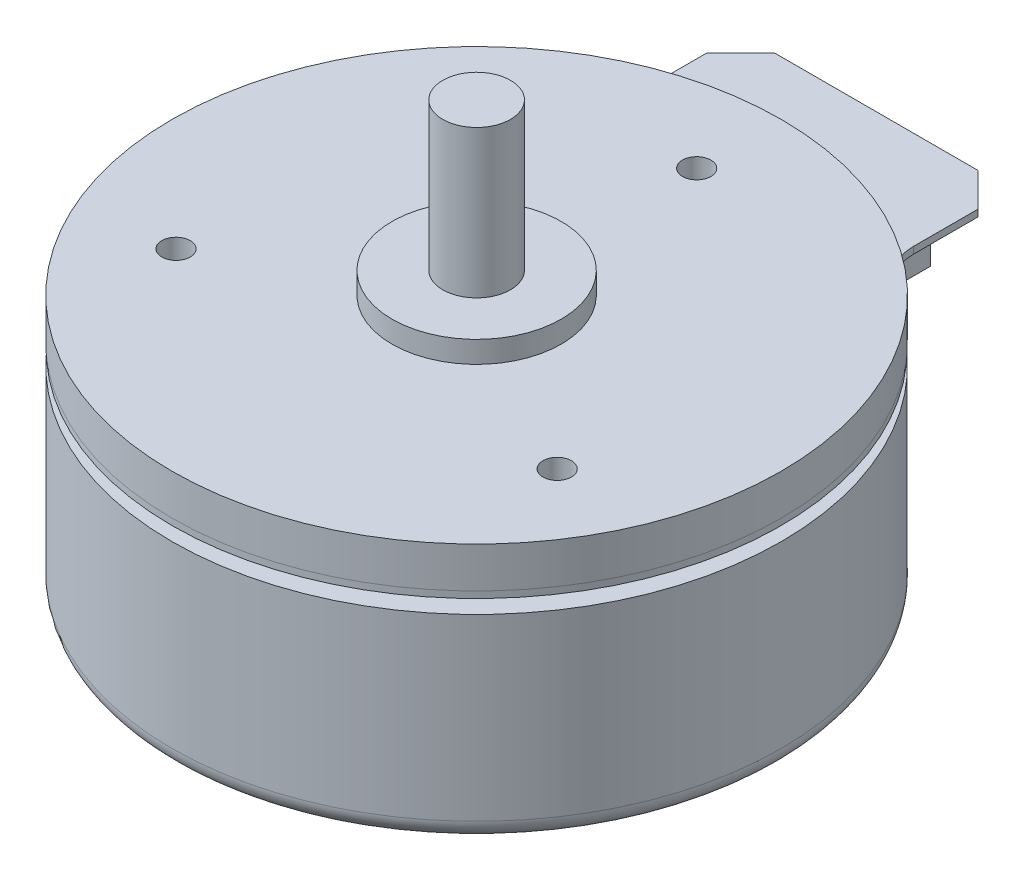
ISO-10303-21;
HEADER;
FILE_DESCRIPTION(('STEP AP214'),'2;1');
FILE_NAME('part.step','',(''),(''),'','','');
FILE_SCHEMA(('AUTOMOTIVE_DESIGN { 1 0 10303 214 1 1 1 1 }'));
ENDSEC;
DATA;
#1=APPLICATION_CONTEXT('core data for automotive mechanical design processes');
#2=APPLICATION_PROTOCOL_DEFINITION('international standard','automotive_design',2000,#1);
#3=PRODUCT_CONTEXT('',#1,'mechanical');
#4=PRODUCT('Part','Part','',(#3));
#5=PRODUCT_RELATED_PRODUCT_CATEGORY('part','',(#4));
#6=PRODUCT_DEFINITION_FORMATION('','',#4);
#7=PRODUCT_DEFINITION_CONTEXT('part definition',#1,'design');
#8=PRODUCT_DEFINITION('design','',#6,#7);
#9=PRODUCT_DEFINITION_SHAPE('','',#8);
#10=(LENGTH_UNIT() NAMED_UNIT(*) SI_UNIT(.MILLI.,.METRE.));
#11=(NAMED_UNIT(*) PLANE_ANGLE_UNIT() SI_UNIT($,.RADIAN.));
#12=(NAMED_UNIT(*) SI_UNIT($,.STERADIAN.) SOLID_ANGLE_UNIT());
#13=UNCERTAINTY_MEASURE_WITH_UNIT(LENGTH_MEASURE(1.E-05),#10,'distance_accuracy_value','');
#14=(GEOMETRIC_REPRESENTATION_CONTEXT(3) GLOBAL_UNCERTAINTY_ASSIGNED_CONTEXT((#13)) GLOBAL_UNIT_ASSIGNED_CONTEXT((#10,
#11,#12)) REPRESENTATION_CONTEXT('',''));
#15=CARTESIAN_POINT('',(0.,0.,0.));
#16=DIRECTION('',(0.,0.,1.));
#17=DIRECTION('',(1.,0.,0.));
#18=AXIS2_PLACEMENT_3D('',#15,#16,#17);
#19=CARTESIAN_POINT('',(0.,6.,0.));
#20=DIRECTION('',(0.,-1.,0.));
#21=DIRECTION('',(0.,0.,-1.));
#22=AXIS2_PLACEMENT_3D('',#19,#20,#21);
#23=CYLINDRICAL_SURFACE('',#22,45.);
#24=CARTESIAN_POINT('',(0.,6.,0.));
#25=DIRECTION('',(0.,1.,0.));
#26=DIRECTION('',(0.,0.,1.));
#27=AXIS2_PLACEMENT_3D('',#24,#25,#26);
#28=CIRCLE('',#27,45.);
#29=CARTESIAN_POINT('',(0.,6.,45.));
#30=VERTEX_POINT('',#29);
#31=EDGE_CURVE('E267',#30,#30,#28,.T.);
#32=ORIENTED_EDGE('',*,*,#31,.F.);
#33=EDGE_LOOP('',(#32));
#34=FACE_BOUND('',#33,.T.);
#35=CARTESIAN_POINT('',(0.,0.,0.));
#36=DIRECTION('',(0.,1.,0.));
#37=DIRECTION('',(0.,0.,1.));
#38=AXIS2_PLACEMENT_3D('',#35,#36,#37);
#39=CIRCLE('',#38,45.);
#40=CARTESIAN_POINT('',(22.8146582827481,0.,-38.7877734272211));
#41=VERTEX_POINT('',#40);
#42=CARTESIAN_POINT('',(-22.8146582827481,0.,-38.787773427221));
#43=VERTEX_POINT('',#42);
#44=EDGE_CURVE('E270',#41,#43,#39,.T.);
#45=ORIENTED_EDGE('',*,*,#44,.T.);
#46=EDGE_CURVE('E263',#43,#41,#39,.T.);
#47=ORIENTED_EDGE('',*,*,#46,.T.);
#48=EDGE_LOOP('',(#45,#47));
#49=FACE_BOUND('',#48,.T.);
#50=ADVANCED_FACE('F35',(#34,#49),#23,.T.);
#51=CARTESIAN_POINT('',(0.,6.,0.));
#52=DIRECTION('',(0.,1.,0.));
#53=DIRECTION('',(0.,0.,1.));
#54=AXIS2_PLACEMENT_3D('',#51,#52,#53);
#55=PLANE('',#54);
#56=CARTESIAN_POINT('',(0.,6.,-32.5));
#57=DIRECTION('',(0.,1.,0.));
#58=DIRECTION('',(0.,0.,1.));
#59=AXIS2_PLACEMENT_3D('',#56,#57,#58);
#60=CIRCLE('',#59,2.1);
#61=CARTESIAN_POINT('',(0.,6.,-30.4));
#62=VERTEX_POINT('',#61);
#63=EDGE_CURVE('E238',#62,#62,#60,.T.);
#64=ORIENTED_EDGE('',*,*,#63,.F.);
#65=EDGE_LOOP('',(#64));
#66=FACE_BOUND('',#65,.T.);
#67=CARTESIAN_POINT('',(28.1458256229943,6.,16.2499999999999));
#68=DIRECTION('',(0.,1.,0.));
#69=DIRECTION('',(0.,0.,1.));
#70=AXIS2_PLACEMENT_3D('',#67,#68,#69);
#71=CIRCLE('',#70,2.1);
#72=CARTESIAN_POINT('',(28.1458256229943,6.,18.3499999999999));
#73=VERTEX_POINT('',#72);
#74=EDGE_CURVE('E244',#73,#73,#71,.T.);
#75=ORIENTED_EDGE('',*,*,#74,.F.);
#76=EDGE_LOOP('',(#75));
#77=FACE_BOUND('',#76,.T.);
#78=CARTESIAN_POINT('',(-28.1458256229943,6.,16.2499999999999));
#79=DIRECTION('',(0.,1.,0.));
#80=DIRECTION('',(0.,0.,1.));
#81=AXIS2_PLACEMENT_3D('',#78,#79,#80);
#82=CIRCLE('',#81,2.1);
#83=CARTESIAN_POINT('',(-28.1458256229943,6.,18.3499999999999));
#84=VERTEX_POINT('',#83);
#85=EDGE_CURVE('E250',#84,#84,#82,.T.);
#86=ORIENTED_EDGE('',*,*,#85,.F.);
#87=EDGE_LOOP('',(#86));
#88=FACE_BOUND('',#87,.T.);
#89=CARTESIAN_POINT('',(0.,6.,0.));
#90=DIRECTION('',(0.,1.,0.));
#91=DIRECTION('',(0.,0.,1.));
#92=AXIS2_PLACEMENT_3D('',#89,#90,#91);
#93=CIRCLE('',#92,12.5);
#94=CARTESIAN_POINT('',(0.,6.,12.5));
#95=VERTEX_POINT('',#94);
#96=EDGE_CURVE('E264',#95,#95,#93,.T.);
#97=ORIENTED_EDGE('',*,*,#96,.F.);
#98=EDGE_LOOP('',(#97));
#99=FACE_BOUND('',#98,.T.);
#100=ORIENTED_EDGE('',*,*,#31,.T.);
#101=EDGE_LOOP('',(#100));
#102=FACE_BOUND('',#101,.T.);
#103=ADVANCED_FACE('F343',(#66,#77,#88,#99,#102),#55,.T.);
#104=CARTESIAN_POINT('',(0.,0.,0.));
#105=DIRECTION('',(0.,1.,0.));
#106=DIRECTION('',(0.,0.,1.));
#107=AXIS2_PLACEMENT_3D('',#104,#105,#106);
#108=PLANE('',#107);
#109=CARTESIAN_POINT('',(27.25,0.,-44.5227750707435));
#110=DIRECTION('',(0.,1.,0.));
#111=DIRECTION('',(0.,0.,1.));
#112=AXIS2_PLACEMENT_3D('',#109,#110,#111);
#113=CIRCLE('',#112,7.25000000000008);
#114=CARTESIAN_POINT('',(23.4652777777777,0.,-38.3390563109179));
#115=VERTEX_POINT('',#114);
#116=EDGE_CURVE('E179',#41,#115,#113,.T.);
#117=ORIENTED_EDGE('',*,*,#116,.F.);
#118=ORIENTED_EDGE('',*,*,#46,.F.);
#119=CARTESIAN_POINT('',(-27.25,0.,-44.5227750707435));
#120=DIRECTION('',(0.,1.,0.));
#121=DIRECTION('',(0.,0.,-1.));
#122=AXIS2_PLACEMENT_3D('',#119,#120,#121);
#123=CIRCLE('',#122,7.25000000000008);
#124=CARTESIAN_POINT('',(-23.4652777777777,0.,-38.339056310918));
#125=VERTEX_POINT('',#124);
#126=EDGE_CURVE('E203',#125,#43,#123,.T.);
#127=ORIENTED_EDGE('',*,*,#126,.F.);
#128=CARTESIAN_POINT('',(0.,0.,0.));
#129=DIRECTION('',(0.,-1.,0.));
#130=DIRECTION('',(0.,0.,1.));
#131=AXIS2_PLACEMENT_3D('',#128,#129,#130);
#132=CIRCLE('',#131,44.95);
#133=EDGE_CURVE('E58',#115,#125,#132,.T.);
#134=ORIENTED_EDGE('',*,*,#133,.F.);
#135=EDGE_LOOP('',(#117,#118,#127,#134));
#136=FACE_BOUND('',#135,.T.);
#137=ADVANCED_FACE('F340',(#136),#108,.F.);
#138=CARTESIAN_POINT('',(0.,9.2,0.));
#139=DIRECTION('',(0.,-1.,0.));
#140=DIRECTION('',(0.,0.,-1.));
#141=AXIS2_PLACEMENT_3D('',#138,#139,#140);
#142=CYLINDRICAL_SURFACE('',#141,12.5);
#143=CARTESIAN_POINT('',(0.,9.2,0.));
#144=DIRECTION('',(0.,1.,0.));
#145=DIRECTION('',(0.,0.,1.));
#146=AXIS2_PLACEMENT_3D('',#143,#144,#145);
#147=CIRCLE('',#146,12.5);
#148=CARTESIAN_POINT('',(0.,9.2,12.5));
#149=VERTEX_POINT('',#148);
#150=EDGE_CURVE('E260',#149,#149,#147,.T.);
#151=ORIENTED_EDGE('',*,*,#150,.F.);
#152=EDGE_LOOP('',(#151));
#153=FACE_BOUND('',#152,.T.);
#154=ORIENTED_EDGE('',*,*,#96,.T.);
#155=EDGE_LOOP('',(#154));
#156=FACE_BOUND('',#155,.T.);
#157=ADVANCED_FACE('F342',(#153,#156),#142,.T.);
#158=CARTESIAN_POINT('',(0.,9.2,0.));
#159=DIRECTION('',(0.,1.,0.));
#160=DIRECTION('',(0.,0.,1.));
#161=AXIS2_PLACEMENT_3D('',#158,#159,#160);
#162=PLANE('',#161);
#163=CARTESIAN_POINT('',(0.,9.2,0.));
#164=DIRECTION('',(0.,1.,0.));
#165=DIRECTION('',(0.,0.,1.));
#166=AXIS2_PLACEMENT_3D('',#163,#164,#165);
#167=CIRCLE('',#166,5.);
#168=CARTESIAN_POINT('',(0.,9.2,5.));
#169=VERTEX_POINT('',#168);
#170=EDGE_CURVE('E259',#169,#169,#167,.F.);
#171=ORIENTED_EDGE('',*,*,#170,.T.);
#172=EDGE_LOOP('',(#171));
#173=FACE_BOUND('',#172,.T.);
#174=ORIENTED_EDGE('',*,*,#150,.T.);
#175=EDGE_LOOP('',(#174));
#176=FACE_BOUND('',#175,.T.);
#177=ADVANCED_FACE('F349',(#173,#176),#162,.T.);
#178=CARTESIAN_POINT('',(0.,31.,0.));
#179=DIRECTION('',(0.,-1.,0.));
#180=DIRECTION('',(0.,0.,-1.));
#181=AXIS2_PLACEMENT_3D('',#178,#179,#180);
#182=CYLINDRICAL_SURFACE('',#181,5.);
#183=ORIENTED_EDGE('',*,*,#170,.F.);
#184=EDGE_LOOP('',(#183));
#185=FACE_BOUND('',#184,.T.);
#186=CARTESIAN_POINT('',(0.,31.,0.));
#187=DIRECTION('',(0.,1.,0.));
#188=DIRECTION('',(0.,0.,1.));
#189=AXIS2_PLACEMENT_3D('',#186,#187,#188);
#190=CIRCLE('',#189,5.);
#191=CARTESIAN_POINT('',(0.,31.,5.));
#192=VERTEX_POINT('',#191);
#193=EDGE_CURVE('E256',#192,#192,#190,.T.);
#194=ORIENTED_EDGE('',*,*,#193,.F.);
#195=EDGE_LOOP('',(#194));
#196=FACE_BOUND('',#195,.T.);
#197=ADVANCED_FACE('F630',(#185,#196),#182,.T.);
#198=CARTESIAN_POINT('',(0.,31.,0.));
#199=DIRECTION('',(0.,1.,0.));
#200=DIRECTION('',(0.,0.,1.));
#201=AXIS2_PLACEMENT_3D('',#198,#199,#200);
#202=PLANE('',#201);
#203=ORIENTED_EDGE('',*,*,#193,.T.);
#204=EDGE_LOOP('',(#203));
#205=FACE_BOUND('',#204,.T.);
#206=ADVANCED_FACE('F372',(#205),#202,.T.);
#207=CARTESIAN_POINT('',(-28.1458256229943,1.46180729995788,16.2499999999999));
#208=DIRECTION('',(0.,1.,0.));
#209=DIRECTION('',(0.,0.,1.));
#210=AXIS2_PLACEMENT_3D('',#207,#208,#209);
#211=CONICAL_SURFACE('',#210,2.1,1.02974425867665);
#212=CARTESIAN_POINT('',(-28.1458256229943,0.200000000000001,16.2499999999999));
#213=VERTEX_POINT('',#212);
#214=VERTEX_LOOP('',#213);
#215=FACE_BOUND('',#214,.T.);
#216=CARTESIAN_POINT('',(-28.1458256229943,1.46180729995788,16.2499999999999));
#217=DIRECTION('',(0.,1.,0.));
#218=DIRECTION('',(0.,0.,1.));
#219=AXIS2_PLACEMENT_3D('',#216,#217,#218);
#220=CIRCLE('',#219,2.1);
#221=CARTESIAN_POINT('',(-28.1458256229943,1.46180729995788,18.3499999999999));
#222=VERTEX_POINT('',#221);
#223=EDGE_CURVE('E253',#222,#222,#220,.T.);
#224=ORIENTED_EDGE('',*,*,#223,.T.);
#225=EDGE_LOOP('',(#224));
#226=FACE_BOUND('',#225,.T.);
#227=ADVANCED_FACE('F377',(#215,#226),#211,.F.);
#228=CARTESIAN_POINT('',(-28.1458256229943,6.,16.2499999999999));
#229=DIRECTION('',(0.,1.,0.));
#230=DIRECTION('',(0.,0.,1.));
#231=AXIS2_PLACEMENT_3D('',#228,#229,#230);
#232=CYLINDRICAL_SURFACE('',#231,2.1);
#233=ORIENTED_EDGE('',*,*,#223,.F.);
#234=EDGE_LOOP('',(#233));
#235=FACE_BOUND('',#234,.T.);
#236=ORIENTED_EDGE('',*,*,#85,.T.);
#237=EDGE_LOOP('',(#236));
#238=FACE_BOUND('',#237,.T.);
#239=ADVANCED_FACE('F382',(#235,#238),#232,.F.);
#240=CARTESIAN_POINT('',(28.1458256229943,1.46180729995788,16.2499999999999));
#241=DIRECTION('',(0.,1.,0.));
#242=DIRECTION('',(0.,0.,1.));
#243=AXIS2_PLACEMENT_3D('',#240,#241,#242);
#244=CONICAL_SURFACE('',#243,2.1,1.02974425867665);
#245=CARTESIAN_POINT('',(28.1458256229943,0.200000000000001,16.2499999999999));
#246=VERTEX_POINT('',#245);
#247=VERTEX_LOOP('',#246);
#248=FACE_BOUND('',#247,.T.);
#249=CARTESIAN_POINT('',(28.1458256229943,1.46180729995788,16.2499999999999));
#250=DIRECTION('',(0.,1.,0.));
#251=DIRECTION('',(0.,0.,1.));
#252=AXIS2_PLACEMENT_3D('',#249,#250,#251);
#253=CIRCLE('',#252,2.1);
#254=CARTESIAN_POINT('',(28.1458256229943,1.46180729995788,18.3499999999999));
#255=VERTEX_POINT('',#254);
#256=EDGE_CURVE('E247',#255,#255,#253,.T.);
#257=ORIENTED_EDGE('',*,*,#256,.T.);
#258=EDGE_LOOP('',(#257));
#259=FACE_BOUND('',#258,.T.);
#260=ADVANCED_FACE('F392',(#248,#259),#244,.F.);
#261=CARTESIAN_POINT('',(28.1458256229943,6.,16.2499999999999));
#262=DIRECTION('',(0.,1.,0.));
#263=DIRECTION('',(0.,0.,1.));
#264=AXIS2_PLACEMENT_3D('',#261,#262,#263);
#265=CYLINDRICAL_SURFACE('',#264,2.1);
#266=ORIENTED_EDGE('',*,*,#256,.F.);
#267=EDGE_LOOP('',(#266));
#268=FACE_BOUND('',#267,.T.);
#269=ORIENTED_EDGE('',*,*,#74,.T.);
#270=EDGE_LOOP('',(#269));
#271=FACE_BOUND('',#270,.T.);
#272=ADVANCED_FACE('F402',(#268,#271),#265,.F.);
#273=CARTESIAN_POINT('',(0.,1.46180729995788,-32.5));
#274=DIRECTION('',(0.,1.,0.));
#275=DIRECTION('',(0.,0.,1.));
#276=AXIS2_PLACEMENT_3D('',#273,#274,#275);
#277=CONICAL_SURFACE('',#276,2.1,1.02974425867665);
#278=CARTESIAN_POINT('',(0.,0.200000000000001,-32.5));
#279=VERTEX_POINT('',#278);
#280=VERTEX_LOOP('',#279);
#281=FACE_BOUND('',#280,.T.);
#282=CARTESIAN_POINT('',(0.,1.46180729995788,-32.5));
#283=DIRECTION('',(0.,1.,0.));
#284=DIRECTION('',(0.,0.,1.));
#285=AXIS2_PLACEMENT_3D('',#282,#283,#284);
#286=CIRCLE('',#285,2.1);
#287=CARTESIAN_POINT('',(0.,1.46180729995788,-30.4));
#288=VERTEX_POINT('',#287);
#289=EDGE_CURVE('E241',#288,#288,#286,.T.);
#290=ORIENTED_EDGE('',*,*,#289,.T.);
#291=EDGE_LOOP('',(#290));
#292=FACE_BOUND('',#291,.T.);
#293=ADVANCED_FACE('F412',(#281,#292),#277,.F.);
#294=CARTESIAN_POINT('',(0.,6.,-32.5));
#295=DIRECTION('',(0.,1.,0.));
#296=DIRECTION('',(0.,0.,1.));
#297=AXIS2_PLACEMENT_3D('',#294,#295,#296);
#298=CYLINDRICAL_SURFACE('',#297,2.1);
#299=ORIENTED_EDGE('',*,*,#289,.F.);
#300=EDGE_LOOP('',(#299));
#301=FACE_BOUND('',#300,.T.);
#302=ORIENTED_EDGE('',*,*,#63,.T.);
#303=EDGE_LOOP('',(#302));
#304=FACE_BOUND('',#303,.T.);
#305=ADVANCED_FACE('F421',(#301,#304),#298,.F.);
#306=CARTESIAN_POINT('',(27.25,0.,-44.5227750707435));
#307=DIRECTION('',(0.,1.,0.));
#308=DIRECTION('',(0.,0.,1.));
#309=AXIS2_PLACEMENT_3D('',#306,#307,#308);
#310=PLANE('',#309);
#311=ORIENTED_EDGE('',*,*,#44,.F.);
#312=CARTESIAN_POINT('',(20.,0.,-44.5227750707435));
#313=VERTEX_POINT('',#312);
#314=EDGE_CURVE('E174',#313,#41,#113,.T.);
#315=ORIENTED_EDGE('',*,*,#314,.F.);
#316=DIRECTION('',(0.,0.,1.));
#317=VECTOR('',#316,1.);
#318=CARTESIAN_POINT('',(20.,0.,-44.5227750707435));
#319=LINE('',#318,#317);
#320=CARTESIAN_POINT('',(20.,0.,-54.0502525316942));
#321=VERTEX_POINT('',#320);
#322=EDGE_CURVE('E184',#321,#313,#319,.T.);
#323=ORIENTED_EDGE('',*,*,#322,.F.);
#324=DIRECTION('',(0.707106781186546,0.,0.707106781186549));
#325=VECTOR('',#324,1.);
#326=CARTESIAN_POINT('',(20.,0.,-54.0502525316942));
#327=LINE('',#326,#325);
#328=CARTESIAN_POINT('',(15.0502525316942,0.,-59.));
#329=VERTEX_POINT('',#328);
#330=EDGE_CURVE('E212',#329,#321,#327,.T.);
#331=ORIENTED_EDGE('',*,*,#330,.F.);
#332=DIRECTION('',(1.,0.,0.));
#333=VECTOR('',#332,1.);
#334=CARTESIAN_POINT('',(15.0502525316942,0.,-59.));
#335=LINE('',#334,#333);
#336=CARTESIAN_POINT('',(-15.0502525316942,0.,-59.));
#337=VERTEX_POINT('',#336);
#338=EDGE_CURVE('E210',#337,#329,#335,.T.);
#339=ORIENTED_EDGE('',*,*,#338,.F.);
#340=DIRECTION('',(0.707106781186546,0.,-0.707106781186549));
#341=VECTOR('',#340,1.);
#342=CARTESIAN_POINT('',(-15.0502525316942,0.,-59.));
#343=LINE('',#342,#341);
#344=CARTESIAN_POINT('',(-20.,0.,-54.0502525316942));
#345=VERTEX_POINT('',#344);
#346=EDGE_CURVE('E208',#345,#337,#343,.T.);
#347=ORIENTED_EDGE('',*,*,#346,.F.);
#348=DIRECTION('',(0.,0.,-1.));
#349=VECTOR('',#348,1.);
#350=CARTESIAN_POINT('',(-20.,0.,-54.0502525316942));
#351=LINE('',#350,#349);
#352=CARTESIAN_POINT('',(-20.,0.,-44.5227750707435));
#353=VERTEX_POINT('',#352);
#354=EDGE_CURVE('E206',#353,#345,#351,.T.);
#355=ORIENTED_EDGE('',*,*,#354,.F.);
#356=EDGE_CURVE('E202',#43,#353,#123,.T.);
#357=ORIENTED_EDGE('',*,*,#356,.F.);
#358=EDGE_LOOP('',(#311,#315,#323,#331,#339,#347,#355,#357));
#359=FACE_BOUND('',#358,.T.);
#360=ADVANCED_FACE('F336',(#359),#310,.T.);
#361=CARTESIAN_POINT('',(27.25,-1.,-44.5227750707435));
#362=DIRECTION('',(0.,1.,0.));
#363=DIRECTION('',(0.,0.,1.));
#364=AXIS2_PLACEMENT_3D('',#361,#362,#363);
#365=CYLINDRICAL_SURFACE('',#364,7.25000000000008);
#366=ORIENTED_EDGE('',*,*,#314,.T.);
#367=ORIENTED_EDGE('',*,*,#116,.T.);
#368=DIRECTION('',(0.,1.,0.));
#369=VECTOR('',#368,1.);
#370=CARTESIAN_POINT('',(23.4652777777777,-1.,-38.3390563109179));
#371=LINE('',#370,#369);
#372=CARTESIAN_POINT('',(23.4652777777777,-1.,-38.3390563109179));
#373=VERTEX_POINT('',#372);
#374=EDGE_CURVE('E235',#373,#115,#371,.T.);
#375=ORIENTED_EDGE('',*,*,#374,.F.);
#376=CARTESIAN_POINT('',(27.25,-1.,-44.5227750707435));
#377=DIRECTION('',(0.,1.,0.));
#378=DIRECTION('',(0.,0.,1.));
#379=AXIS2_PLACEMENT_3D('',#376,#377,#378);
#380=CIRCLE('',#379,7.25000000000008);
#381=CARTESIAN_POINT('',(20.,-1.,-44.5227750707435));
#382=VERTEX_POINT('',#381);
#383=EDGE_CURVE('E180',#382,#373,#380,.T.);
#384=ORIENTED_EDGE('',*,*,#383,.F.);
#385=DIRECTION('',(0.,1.,0.));
#386=VECTOR('',#385,1.);
#387=CARTESIAN_POINT('',(20.,-1.,-44.5227750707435));
#388=LINE('',#387,#386);
#389=EDGE_CURVE('E198',#382,#313,#388,.T.);
#390=ORIENTED_EDGE('',*,*,#389,.T.);
#391=EDGE_LOOP('',(#366,#367,#375,#384,#390));
#392=FACE_BOUND('',#391,.T.);
#393=ADVANCED_FACE('F304',(#392),#365,.F.);
#394=CARTESIAN_POINT('',(0.,-1.,0.));
#395=DIRECTION('',(0.,1.,0.));
#396=DIRECTION('',(0.,0.,1.));
#397=AXIS2_PLACEMENT_3D('',#394,#395,#396);
#398=CYLINDRICAL_SURFACE('',#397,44.95);
#399=ORIENTED_EDGE('',*,*,#133,.T.);
#400=DIRECTION('',(0.,1.,0.));
#401=VECTOR('',#400,1.);
#402=CARTESIAN_POINT('',(-23.4652777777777,-1.,-38.339056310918));
#403=LINE('',#402,#401);
#404=CARTESIAN_POINT('',(-23.4652777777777,-1.,-38.339056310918));
#405=VERTEX_POINT('',#404);
#406=EDGE_CURVE('E232',#405,#125,#403,.T.);
#407=ORIENTED_EDGE('',*,*,#406,.F.);
#408=CARTESIAN_POINT('',(0.,-1.,0.));
#409=DIRECTION('',(0.,-1.,0.));
#410=DIRECTION('',(0.,0.,1.));
#411=AXIS2_PLACEMENT_3D('',#408,#409,#410);
#412=CIRCLE('',#411,44.95);
#413=EDGE_CURVE('E183',#373,#405,#412,.T.);
#414=ORIENTED_EDGE('',*,*,#413,.F.);
#415=ORIENTED_EDGE('',*,*,#374,.T.);
#416=EDGE_LOOP('',(#399,#407,#414,#415));
#417=FACE_BOUND('',#416,.T.);
#418=ADVANCED_FACE('F306',(#417),#398,.T.);
#419=CARTESIAN_POINT('',(-27.25,-1.,-44.5227750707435));
#420=DIRECTION('',(0.,1.,0.));
#421=DIRECTION('',(0.,0.,1.));
#422=AXIS2_PLACEMENT_3D('',#419,#420,#421);
#423=CYLINDRICAL_SURFACE('',#422,7.25000000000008);
#424=ORIENTED_EDGE('',*,*,#126,.T.);
#425=ORIENTED_EDGE('',*,*,#356,.T.);
#426=DIRECTION('',(0.,1.,0.));
#427=VECTOR('',#426,1.);
#428=CARTESIAN_POINT('',(-20.,-1.,-44.5227750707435));
#429=LINE('',#428,#427);
#430=CARTESIAN_POINT('',(-20.,-1.,-44.5227750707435));
#431=VERTEX_POINT('',#430);
#432=EDGE_CURVE('E229',#431,#353,#429,.T.);
#433=ORIENTED_EDGE('',*,*,#432,.F.);
#434=CARTESIAN_POINT('',(-27.25,-1.,-44.5227750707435));
#435=DIRECTION('',(0.,1.,0.));
#436=DIRECTION('',(0.,0.,-1.));
#437=AXIS2_PLACEMENT_3D('',#434,#435,#436);
#438=CIRCLE('',#437,7.25000000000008);
#439=EDGE_CURVE('E186',#405,#431,#438,.T.);
#440=ORIENTED_EDGE('',*,*,#439,.F.);
#441=ORIENTED_EDGE('',*,*,#406,.T.);
#442=EDGE_LOOP('',(#424,#425,#433,#440,#441));
#443=FACE_BOUND('',#442,.T.);
#444=ADVANCED_FACE('F310',(#443),#423,.F.);
#445=CARTESIAN_POINT('',(-20.,-1.,-54.0502525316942));
#446=DIRECTION('',(1.,0.,0.));
#447=DIRECTION('',(0.,0.,-1.));
#448=AXIS2_PLACEMENT_3D('',#445,#446,#447);
#449=PLANE('',#448);
#450=ORIENTED_EDGE('',*,*,#354,.T.);
#451=DIRECTION('',(0.,1.,0.));
#452=VECTOR('',#451,1.);
#453=CARTESIAN_POINT('',(-20.,-1.,-54.0502525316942));
#454=LINE('',#453,#452);
#455=CARTESIAN_POINT('',(-20.,-1.,-54.0502525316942));
#456=VERTEX_POINT('',#455);
#457=EDGE_CURVE('E226',#456,#345,#454,.T.);
#458=ORIENTED_EDGE('',*,*,#457,.F.);
#459=DIRECTION('',(0.,0.,-1.));
#460=VECTOR('',#459,1.);
#461=CARTESIAN_POINT('',(-20.,-1.,-54.0502525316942));
#462=LINE('',#461,#460);
#463=EDGE_CURVE('E188',#431,#456,#462,.T.);
#464=ORIENTED_EDGE('',*,*,#463,.F.);
#465=ORIENTED_EDGE('',*,*,#432,.T.);
#466=EDGE_LOOP('',(#450,#458,#464,#465));
#467=FACE_BOUND('',#466,.T.);
#468=ADVANCED_FACE('F316',(#467),#449,.F.);
#469=CARTESIAN_POINT('',(-15.0502525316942,-1.,-59.));
#470=DIRECTION('',(0.707106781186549,0.,0.707106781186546));
#471=DIRECTION('',(0.707106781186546,0.,-0.707106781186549));
#472=AXIS2_PLACEMENT_3D('',#469,#470,#471);
#473=PLANE('',#472);
#474=ORIENTED_EDGE('',*,*,#346,.T.);
#475=DIRECTION('',(0.,1.,0.));
#476=VECTOR('',#475,1.);
#477=CARTESIAN_POINT('',(-15.0502525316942,-1.,-59.));
#478=LINE('',#477,#476);
#479=CARTESIAN_POINT('',(-15.0502525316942,-1.,-59.));
#480=VERTEX_POINT('',#479);
#481=EDGE_CURVE('E223',#480,#337,#478,.T.);
#482=ORIENTED_EDGE('',*,*,#481,.F.);
#483=DIRECTION('',(0.707106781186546,0.,-0.707106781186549));
#484=VECTOR('',#483,1.);
#485=CARTESIAN_POINT('',(-15.0502525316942,-1.,-59.));
#486=LINE('',#485,#484);
#487=EDGE_CURVE('E190',#456,#480,#486,.T.);
#488=ORIENTED_EDGE('',*,*,#487,.F.);
#489=ORIENTED_EDGE('',*,*,#457,.T.);
#490=EDGE_LOOP('',(#474,#482,#488,#489));
#491=FACE_BOUND('',#490,.T.);
#492=ADVANCED_FACE('F320',(#491),#473,.F.);
#493=CARTESIAN_POINT('',(15.0502525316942,-1.,-59.));
#494=DIRECTION('',(0.,0.,1.));
#495=DIRECTION('',(1.,0.,0.));
#496=AXIS2_PLACEMENT_3D('',#493,#494,#495);
#497=PLANE('',#496);
#498=ORIENTED_EDGE('',*,*,#338,.T.);
#499=DIRECTION('',(0.,1.,0.));
#500=VECTOR('',#499,1.);
#501=CARTESIAN_POINT('',(15.0502525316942,-1.,-59.));
#502=LINE('',#501,#500);
#503=CARTESIAN_POINT('',(15.0502525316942,-1.,-59.));
#504=VERTEX_POINT('',#503);
#505=EDGE_CURVE('E220',#504,#329,#502,.T.);
#506=ORIENTED_EDGE('',*,*,#505,.F.);
#507=DIRECTION('',(1.,0.,0.));
#508=VECTOR('',#507,1.);
#509=CARTESIAN_POINT('',(15.0502525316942,-1.,-59.));
#510=LINE('',#509,#508);
#511=EDGE_CURVE('E192',#480,#504,#510,.T.);
#512=ORIENTED_EDGE('',*,*,#511,.F.);
#513=ORIENTED_EDGE('',*,*,#481,.T.);
#514=EDGE_LOOP('',(#498,#506,#512,#513));
#515=FACE_BOUND('',#514,.T.);
#516=ADVANCED_FACE('F325',(#515),#497,.F.);
#517=CARTESIAN_POINT('',(20.,-1.,-54.0502525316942));
#518=DIRECTION('',(-0.707106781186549,0.,0.707106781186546));
#519=DIRECTION('',(0.707106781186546,0.,0.707106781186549));
#520=AXIS2_PLACEMENT_3D('',#517,#518,#519);
#521=PLANE('',#520);
#522=ORIENTED_EDGE('',*,*,#330,.T.);
#523=DIRECTION('',(0.,1.,0.));
#524=VECTOR('',#523,1.);
#525=CARTESIAN_POINT('',(20.,-1.,-54.0502525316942));
#526=LINE('',#525,#524);
#527=CARTESIAN_POINT('',(20.,-1.,-54.0502525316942));
#528=VERTEX_POINT('',#527);
#529=EDGE_CURVE('E217',#528,#321,#526,.T.);
#530=ORIENTED_EDGE('',*,*,#529,.F.);
#531=DIRECTION('',(0.707106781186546,0.,0.707106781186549));
#532=VECTOR('',#531,1.);
#533=CARTESIAN_POINT('',(20.,-1.,-54.0502525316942));
#534=LINE('',#533,#532);
#535=EDGE_CURVE('E194',#504,#528,#534,.T.);
#536=ORIENTED_EDGE('',*,*,#535,.F.);
#537=ORIENTED_EDGE('',*,*,#505,.T.);
#538=EDGE_LOOP('',(#522,#530,#536,#537));
#539=FACE_BOUND('',#538,.T.);
#540=ADVANCED_FACE('F329',(#539),#521,.F.);
#541=CARTESIAN_POINT('',(20.,-1.,-44.5227750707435));
#542=DIRECTION('',(-1.,0.,0.));
#543=DIRECTION('',(0.,0.,1.));
#544=AXIS2_PLACEMENT_3D('',#541,#542,#543);
#545=PLANE('',#544);
#546=ORIENTED_EDGE('',*,*,#322,.T.);
#547=ORIENTED_EDGE('',*,*,#389,.F.);
#548=DIRECTION('',(0.,0.,1.));
#549=VECTOR('',#548,1.);
#550=CARTESIAN_POINT('',(20.,-1.,-44.5227750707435));
#551=LINE('',#550,#549);
#552=EDGE_CURVE('E196',#528,#382,#551,.T.);
#553=ORIENTED_EDGE('',*,*,#552,.F.);
#554=ORIENTED_EDGE('',*,*,#529,.T.);
#555=EDGE_LOOP('',(#546,#547,#553,#554));
#556=FACE_BOUND('',#555,.T.);
#557=ADVANCED_FACE('F294',(#556),#545,.F.);
#558=CARTESIAN_POINT('',(27.25,-1.,-44.5227750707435));
#559=DIRECTION('',(0.,1.,0.));
#560=DIRECTION('',(0.,0.,1.));
#561=AXIS2_PLACEMENT_3D('',#558,#559,#560);
#562=PLANE('',#561);
#563=DIRECTION('',(0.,0.,-1.));
#564=VECTOR('',#563,1.);
#565=CARTESIAN_POINT('',(-10.,-1.,-44.5227750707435));
#566=LINE('',#565,#564);
#567=CARTESIAN_POINT('',(-10.,-1.,-47.));
#568=VERTEX_POINT('',#567);
#569=CARTESIAN_POINT('',(-10.,-1.,-57.));
#570=VERTEX_POINT('',#569);
#571=EDGE_CURVE('E43',#568,#570,#566,.T.);
#572=ORIENTED_EDGE('',*,*,#571,.F.);
#573=DIRECTION('',(1.,0.,0.));
#574=VECTOR('',#573,1.);
#575=CARTESIAN_POINT('',(27.25,-1.,-47.));
#576=LINE('',#575,#574);
#577=CARTESIAN_POINT('',(10.,-1.,-47.));
#578=VERTEX_POINT('',#577);
#579=EDGE_CURVE('E11',#568,#578,#576,.T.);
#580=ORIENTED_EDGE('',*,*,#579,.T.);
#581=DIRECTION('',(0.,0.,-1.));
#582=VECTOR('',#581,1.);
#583=CARTESIAN_POINT('',(10.,-1.,-44.5227750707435));
#584=LINE('',#583,#582);
#585=CARTESIAN_POINT('',(10.,-1.,-57.));
#586=VERTEX_POINT('',#585);
#587=EDGE_CURVE('E143',#578,#586,#584,.T.);
#588=ORIENTED_EDGE('',*,*,#587,.T.);
#589=DIRECTION('',(1.,0.,0.));
#590=VECTOR('',#589,1.);
#591=CARTESIAN_POINT('',(27.25,-1.,-57.));
#592=LINE('',#591,#590);
#593=EDGE_CURVE('E281',#570,#586,#592,.T.);
#594=ORIENTED_EDGE('',*,*,#593,.F.);
#595=EDGE_LOOP('',(#572,#580,#588,#594));
#596=FACE_BOUND('',#595,.T.);
#597=CARTESIAN_POINT('',(0.,-1.,0.));
#598=DIRECTION('',(0.,-1.,0.));
#599=DIRECTION('',(0.,0.,-1.));
#600=AXIS2_PLACEMENT_3D('',#597,#598,#599);
#601=CIRCLE('',#600,40.);
#602=CARTESIAN_POINT('',(0.,-1.,-40.));
#603=VERTEX_POINT('',#602);
#604=EDGE_CURVE('E175',#603,#603,#601,.T.);
#605=ORIENTED_EDGE('',*,*,#604,.F.);
#606=EDGE_LOOP('',(#605));
#607=FACE_BOUND('',#606,.T.);
#608=ORIENTED_EDGE('',*,*,#383,.T.);
#609=ORIENTED_EDGE('',*,*,#413,.T.);
#610=ORIENTED_EDGE('',*,*,#439,.T.);
#611=ORIENTED_EDGE('',*,*,#463,.T.);
#612=ORIENTED_EDGE('',*,*,#487,.T.);
#613=ORIENTED_EDGE('',*,*,#511,.T.);
#614=ORIENTED_EDGE('',*,*,#535,.T.);
#615=ORIENTED_EDGE('',*,*,#552,.T.);
#616=EDGE_LOOP('',(#608,#609,#610,#611,#612,#613,#614,#615));
#617=FACE_BOUND('',#616,.T.);
#618=ADVANCED_FACE('F290',(#596,#607,#617),#562,.F.);
#619=CARTESIAN_POINT('',(0.,-3.,0.));
#620=DIRECTION('',(0.,1.,0.));
#621=DIRECTION('',(0.,0.,1.));
#622=AXIS2_PLACEMENT_3D('',#619,#620,#621);
#623=CYLINDRICAL_SURFACE('',#622,40.);
#624=CARTESIAN_POINT('',(0.,-3.,0.));
#625=DIRECTION('',(0.,-1.,0.));
#626=DIRECTION('',(0.,0.,-1.));
#627=AXIS2_PLACEMENT_3D('',#624,#625,#626);
#628=CIRCLE('',#627,40.);
#629=CARTESIAN_POINT('',(0.,-3.,-40.));
#630=VERTEX_POINT('',#629);
#631=EDGE_CURVE('E171',#630,#630,#628,.T.);
#632=ORIENTED_EDGE('',*,*,#631,.F.);
#633=EDGE_LOOP('',(#632));
#634=FACE_BOUND('',#633,.T.);
#635=ORIENTED_EDGE('',*,*,#604,.T.);
#636=EDGE_LOOP('',(#635));
#637=FACE_BOUND('',#636,.T.);
#638=ADVANCED_FACE('F293',(#634,#637),#623,.T.);
#639=CARTESIAN_POINT('',(0.,-32.464,0.));
#640=DIRECTION('',(0.,1.,0.));
#641=DIRECTION('',(0.,0.,1.));
#642=AXIS2_PLACEMENT_3D('',#639,#640,#641);
#643=CYLINDRICAL_SURFACE('',#642,45.);
#644=CARTESIAN_POINT('',(0.,-29.464,0.));
#645=DIRECTION('',(0.,-1.,0.));
#646=DIRECTION('',(0.,0.,-1.));
#647=AXIS2_PLACEMENT_3D('',#644,#645,#646);
#648=CIRCLE('',#647,45.);
#649=CARTESIAN_POINT('',(0.,-29.464,-45.));
#650=VERTEX_POINT('',#649);
#651=EDGE_CURVE('E277',#650,#650,#648,.F.);
#652=ORIENTED_EDGE('',*,*,#651,.T.);
#653=EDGE_LOOP('',(#652));
#654=FACE_BOUND('',#653,.T.);
#655=CARTESIAN_POINT('',(0.,-3.,0.));
#656=DIRECTION('',(0.,-1.,0.));
#657=DIRECTION('',(0.,0.,-1.));
#658=AXIS2_PLACEMENT_3D('',#655,#656,#657);
#659=CIRCLE('',#658,45.);
#660=CARTESIAN_POINT('',(0.,-3.,-45.));
#661=VERTEX_POINT('',#660);
#662=EDGE_CURVE('E164',#661,#661,#659,.T.);
#663=ORIENTED_EDGE('',*,*,#662,.T.);
#664=EDGE_LOOP('',(#663));
#665=FACE_BOUND('',#664,.T.);
#666=ADVANCED_FACE('F499',(#654,#665),#643,.T.);
#667=CARTESIAN_POINT('',(0.,-32.464,0.));
#668=DIRECTION('',(0.,-1.,0.));
#669=DIRECTION('',(0.,0.,-1.));
#670=AXIS2_PLACEMENT_3D('',#667,#668,#669);
#671=PLANE('',#670);
#672=CARTESIAN_POINT('',(0.,-32.464,0.));
#673=DIRECTION('',(0.,-1.,0.));
#674=DIRECTION('',(0.,0.,-1.));
#675=AXIS2_PLACEMENT_3D('',#672,#673,#674);
#676=CIRCLE('',#675,42.);
#677=CARTESIAN_POINT('',(0.,-32.464,-42.));
#678=VERTEX_POINT('',#677);
#679=EDGE_CURVE('E178',#678,#678,#676,.T.);
#680=ORIENTED_EDGE('',*,*,#679,.T.);
#681=EDGE_LOOP('',(#680));
#682=FACE_BOUND('',#681,.T.);
#683=ADVANCED_FACE('F508',(#682),#671,.T.);
#684=CARTESIAN_POINT('',(0.,-3.,0.));
#685=DIRECTION('',(0.,-1.,0.));
#686=DIRECTION('',(0.,0.,-1.));
#687=AXIS2_PLACEMENT_3D('',#684,#685,#686);
#688=PLANE('',#687);
#689=ORIENTED_EDGE('',*,*,#631,.T.);
#690=EDGE_LOOP('',(#689));
#691=FACE_BOUND('',#690,.T.);
#692=ORIENTED_EDGE('',*,*,#662,.F.);
#693=EDGE_LOOP('',(#692));
#694=FACE_BOUND('',#693,.T.);
#695=ADVANCED_FACE('F516',(#691,#694),#688,.F.);
#696=CARTESIAN_POINT('',(0.,-29.464,0.));
#697=DIRECTION('',(0.,-1.,0.));
#698=DIRECTION('',(0.,0.,-1.));
#699=AXIS2_PLACEMENT_3D('',#696,#697,#698);
#700=TOROIDAL_SURFACE('',#699,42.,3.);
#701=ORIENTED_EDGE('',*,*,#651,.F.);
#702=EDGE_LOOP('',(#701));
#703=FACE_BOUND('',#702,.T.);
#704=ORIENTED_EDGE('',*,*,#679,.F.);
#705=EDGE_LOOP('',(#704));
#706=FACE_BOUND('',#705,.T.);
#707=ADVANCED_FACE('F37',(#703,#706),#700,.T.);
#708=CARTESIAN_POINT('',(-10.,-13.8,-47.));
#709=DIRECTION('',(0.,0.,1.));
#710=DIRECTION('',(1.,0.,0.));
#711=AXIS2_PLACEMENT_3D('',#708,#709,#710);
#712=PLANE('',#711);
#713=ORIENTED_EDGE('',*,*,#579,.F.);
#714=DIRECTION('',(0.,1.,0.));
#715=VECTOR('',#714,1.);
#716=CARTESIAN_POINT('',(-10.,-13.8,-47.));
#717=LINE('',#716,#715);
#718=CARTESIAN_POINT('',(-10.,-13.8,-47.));
#719=VERTEX_POINT('',#718);
#720=EDGE_CURVE('E157',#719,#568,#717,.T.);
#721=ORIENTED_EDGE('',*,*,#720,.F.);
#722=DIRECTION('',(1.,0.,0.));
#723=VECTOR('',#722,1.);
#724=CARTESIAN_POINT('',(-10.,-13.8,-47.));
#725=LINE('',#724,#723);
#726=CARTESIAN_POINT('',(10.,-13.8,-47.));
#727=VERTEX_POINT('',#726);
#728=EDGE_CURVE('E151',#719,#727,#725,.T.);
#729=ORIENTED_EDGE('',*,*,#728,.T.);
#730=DIRECTION('',(0.,1.,0.));
#731=VECTOR('',#730,1.);
#732=CARTESIAN_POINT('',(10.,-13.8,-47.));
#733=LINE('',#732,#731);
#734=EDGE_CURVE('E138',#727,#578,#733,.T.);
#735=ORIENTED_EDGE('',*,*,#734,.T.);
#736=EDGE_LOOP('',(#713,#721,#729,#735));
#737=FACE_BOUND('',#736,.T.);
#738=ADVANCED_FACE('F155',(#737),#712,.T.);
#739=CARTESIAN_POINT('',(-10.,-13.8,-47.));
#740=DIRECTION('',(1.,0.,0.));
#741=DIRECTION('',(0.,0.,-1.));
#742=AXIS2_PLACEMENT_3D('',#739,#740,#741);
#743=PLANE('',#742);
#744=ORIENTED_EDGE('',*,*,#720,.T.);
#745=ORIENTED_EDGE('',*,*,#571,.T.);
#746=DIRECTION('',(0.,1.,0.));
#747=VECTOR('',#746,1.);
#748=CARTESIAN_POINT('',(-10.,-13.8,-57.));
#749=LINE('',#748,#747);
#750=CARTESIAN_POINT('',(-10.,-13.8,-57.));
#751=VERTEX_POINT('',#750);
#752=EDGE_CURVE('E165',#751,#570,#749,.T.);
#753=ORIENTED_EDGE('',*,*,#752,.F.);
#754=DIRECTION('',(0.,0.,-1.));
#755=VECTOR('',#754,1.);
#756=CARTESIAN_POINT('',(-10.,-13.8,-47.));
#757=LINE('',#756,#755);
#758=EDGE_CURVE('E146',#719,#751,#757,.T.);
#759=ORIENTED_EDGE('',*,*,#758,.F.);
#760=EDGE_LOOP('',(#744,#745,#753,#759));
#761=FACE_BOUND('',#760,.T.);
#762=ADVANCED_FACE('F285',(#761),#743,.F.);
#763=CARTESIAN_POINT('',(-10.,-13.8,-57.));
#764=DIRECTION('',(0.,0.,1.));
#765=DIRECTION('',(1.,0.,0.));
#766=AXIS2_PLACEMENT_3D('',#763,#764,#765);
#767=PLANE('',#766);
#768=ORIENTED_EDGE('',*,*,#752,.T.);
#769=ORIENTED_EDGE('',*,*,#593,.T.);
#770=DIRECTION('',(0.,1.,0.));
#771=VECTOR('',#770,1.);
#772=CARTESIAN_POINT('',(10.,-13.8,-57.));
#773=LINE('',#772,#771);
#774=CARTESIAN_POINT('',(10.,-13.8,-57.));
#775=VERTEX_POINT('',#774);
#776=EDGE_CURVE('E50',#775,#586,#773,.T.);
#777=ORIENTED_EDGE('',*,*,#776,.F.);
#778=DIRECTION('',(1.,0.,0.));
#779=VECTOR('',#778,1.);
#780=CARTESIAN_POINT('',(-10.,-13.8,-57.));
#781=LINE('',#780,#779);
#782=EDGE_CURVE('E153',#751,#775,#781,.T.);
#783=ORIENTED_EDGE('',*,*,#782,.F.);
#784=EDGE_LOOP('',(#768,#769,#777,#783));
#785=FACE_BOUND('',#784,.T.);
#786=ADVANCED_FACE('F289',(#785),#767,.F.);
#787=CARTESIAN_POINT('',(10.,-13.8,-47.));
#788=DIRECTION('',(1.,0.,0.));
#789=DIRECTION('',(0.,0.,-1.));
#790=AXIS2_PLACEMENT_3D('',#787,#788,#789);
#791=PLANE('',#790);
#792=ORIENTED_EDGE('',*,*,#587,.F.);
#793=ORIENTED_EDGE('',*,*,#734,.F.);
#794=DIRECTION('',(0.,0.,-1.));
#795=VECTOR('',#794,1.);
#796=CARTESIAN_POINT('',(10.,-13.8,-47.));
#797=LINE('',#796,#795);
#798=EDGE_CURVE('E141',#727,#775,#797,.T.);
#799=ORIENTED_EDGE('',*,*,#798,.T.);
#800=ORIENTED_EDGE('',*,*,#776,.T.);
#801=EDGE_LOOP('',(#792,#793,#799,#800));
#802=FACE_BOUND('',#801,.T.);
#803=ADVANCED_FACE('F140',(#802),#791,.T.);
#804=CARTESIAN_POINT('',(0.,-13.8,0.));
#805=DIRECTION('',(0.,1.,0.));
#806=DIRECTION('',(0.,0.,1.));
#807=AXIS2_PLACEMENT_3D('',#804,#805,#806);
#808=PLANE('',#807);
#809=ORIENTED_EDGE('',*,*,#728,.F.);
#810=ORIENTED_EDGE('',*,*,#758,.T.);
#811=ORIENTED_EDGE('',*,*,#782,.T.);
#812=ORIENTED_EDGE('',*,*,#798,.F.);
#813=EDGE_LOOP('',(#809,#810,#811,#812));
#814=FACE_BOUND('',#813,.T.);
#815=ADVANCED_FACE('F150',(#814),#808,.F.);
#816=CLOSED_SHELL('',(#50,#103,#137,#157,#177,#197,#206,#227,#239,#260,#272,#293,#305,#360,#393,
#418,#444,#468,#492,#516,#540,#557,#618,#638,#666,#683,#695,#707,#738,#762,#786,#803,#815));
#817=MANIFOLD_SOLID_BREP('B2',#816);
#818=ADVANCED_BREP_SHAPE_REPRESENTATION('',(#18,#817),#14);
#819=SHAPE_DEFINITION_REPRESENTATION(#9,#818);
ENDSEC;
END-ISO-10303-21;
